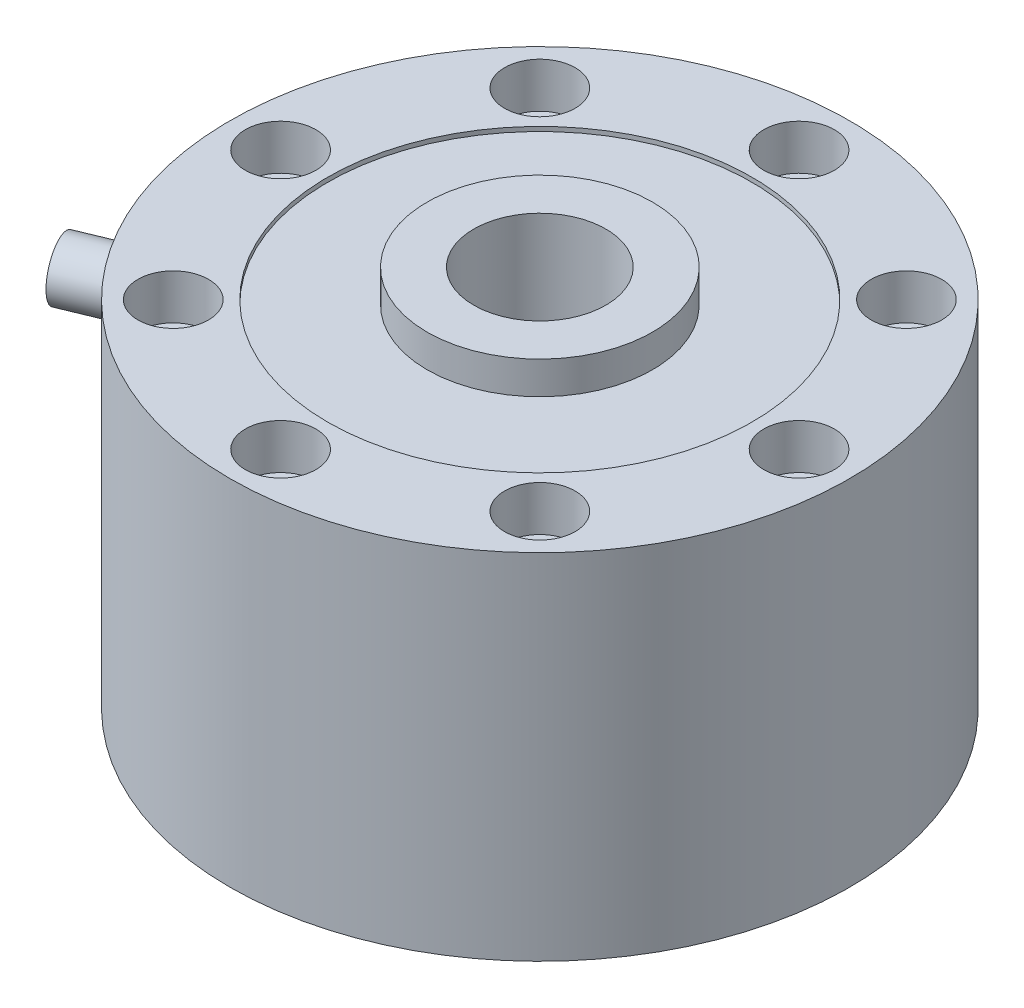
from build123d import *

# Parameters (mm, degrees)
SKETCH1_R                     = 69.85
BOSS_EXTRUDE1_DEPTH           = 79.756
SKETCH2_R                     = 25.4
BOSS_EXTRUDE2_DEPTH           = 6.35
BOSS_EXTRUDE3_START           = 1.27
SKETCH3_R                     = 25.4
BOSS_EXTRUDE3_DEPTH           = 1.27
F_1_1_4_12_TAPPED_HOLE1_D     = 29.76626
F_1_1_4_12_TAPPED_HOLE1_DEPTH = 38.1
F_1_1_4_12_TAPPED_HOLE1_TIP   = 8.942686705
F_1_1_4_12_TAPPED_HOLE4_D     = 29.76626
F_1_1_4_12_TAPPED_HOLE4_DEPTH = 30.48
F_1_1_4_12_TAPPED_HOLE4_TIP   = 8.942686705
SKETCH18_R                    = 5.1562
CUT_EXTRUDE2_DEPTH            = 128.762504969
SKETCH19_R                    = 7.9502
CUT_EXTRUDE3_DEPTH            = 10.16
CIRPATTERN1_COUNT             = 8
CUT_EXTRUDE4_START            = -1
SKETCH20_R                    = 47.818709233
SKETCH20_R_2                  = 25.4
CUT_EXTRUDE4_DEPTH            = 1
BOSS_EXTRUDE4_DEPTH           = 12.7
BOSS_EXTRUDE4_DEPTH_BACK      = 12.7
SKETCH22_R                    = 6.35


with BuildPart() as part:
    # Sketch1 → Boss-Extrude1 (new body)
    with BuildSketch(Plane(origin=(0, 0, 0), x_dir=(1, 0, 0), z_dir=(0, 1, 0))):
        with Locations(Location((0, 0, 0), (0, 0, 270))):
            Circle(SKETCH1_R)
    extrude(amount=BOSS_EXTRUDE1_DEPTH)

    # Sketch2 → Boss-Extrude2 (add)
    with BuildSketch(Plane(origin=(0, 79.756, 0), x_dir=(1, 0, 0), z_dir=(0, 1, 0))):
        with Locations(Location((0, 0, 0), (0, 0, 270))):
            Circle(SKETCH2_R)
    extrude(amount=BOSS_EXTRUDE2_DEPTH)

    # Sketch3 → Boss-Extrude3 (add)
    with BuildSketch(Plane.XZ.offset(BOSS_EXTRUDE3_START)):
        with Locations(Location((0, 0, 0), (0, 0, 90))):
            Circle(SKETCH3_R)
    extrude(amount=-BOSS_EXTRUDE3_DEPTH)

    # 1-1_4-12 Tapped Hole1
    with Locations(Plane(origin=(0, 86.106, 0), x_dir=(1, 0, 0), z_dir=(0, 1, 0))):
        with Locations((0, 0)):
            Hole(F_1_1_4_12_TAPPED_HOLE1_D / 2, depth=F_1_1_4_12_TAPPED_HOLE1_DEPTH)
            with Locations((0, 0, -(F_1_1_4_12_TAPPED_HOLE1_DEPTH + F_1_1_4_12_TAPPED_HOLE1_TIP / 2))):  # 118° drill point
                Cone(0, F_1_1_4_12_TAPPED_HOLE1_D / 2, F_1_1_4_12_TAPPED_HOLE1_TIP, mode=Mode.SUBTRACT)

    # 1-1_4-12 Tapped Hole4
    with Locations(Plane(origin=(0, -1.27, 0), x_dir=(-1, 0, 0), z_dir=(0, -1, 0))):
        with Locations((0, 0)):
            Hole(F_1_1_4_12_TAPPED_HOLE4_D / 2, depth=F_1_1_4_12_TAPPED_HOLE4_DEPTH)
            with Locations((0, 0, -(F_1_1_4_12_TAPPED_HOLE4_DEPTH + F_1_1_4_12_TAPPED_HOLE4_TIP / 2))):  # 118° drill point
                Cone(0, F_1_1_4_12_TAPPED_HOLE4_D / 2, F_1_1_4_12_TAPPED_HOLE4_TIP, mode=Mode.SUBTRACT)

    # Sketch18 → Cut-Extrude2 (cut, through all)
    with BuildSketch(Plane(origin=(0, 79.756, 0), x_dir=(1, 0, 0), z_dir=(0, 1, 0))):
        with Locations(Location((0, 58.42, 0), (0, 0, 270))):
            Circle(SKETCH18_R)
    cut_extrude2 = extrude(amount=-CUT_EXTRUDE2_DEPTH, mode=Mode.SUBTRACT)

    # Sketch19 → Cut-Extrude3 (cut)
    with BuildSketch(Plane(origin=(0, 79.756, 0), x_dir=(1, 0, 0), z_dir=(0, 1, 0))):
        with Locations(Location((0, 58.42, 0), (0, 0, 270))):
            Circle(SKETCH19_R)
    cut_extrude3 = extrude(amount=-CUT_EXTRUDE3_DEPTH, mode=Mode.SUBTRACT)

    # CirPattern1: Cut-Extrude2, Cut-Extrude3 ×8 about axis
    cirpattern1_axis = Axis((0, 0, 0), (0, 1, 0))
    add([cut_extrude2.rotate(cirpattern1_axis, i * 360 / CIRPATTERN1_COUNT) for i in range(1, CIRPATTERN1_COUNT)], mode=Mode.SUBTRACT)
    add([cut_extrude3.rotate(cirpattern1_axis, i * 360 / CIRPATTERN1_COUNT) for i in range(1, CIRPATTERN1_COUNT)], mode=Mode.SUBTRACT)

    # Sketch20 → Cut-Extrude4 (cut)
    with BuildSketch(Plane(origin=(0, 79.756, 0), x_dir=(1, 0, 0), z_dir=(0, 1, 0)).offset(CUT_EXTRUDE4_START)):
        with Locations(Location((0, 0, 0), (0, 0, 270))):
            Circle(SKETCH20_R)
        with Locations(Location((0, 0, 0), (0, 0, 270))):
            Circle(SKETCH20_R_2, mode=Mode.SUBTRACT)
    extrude(amount=CUT_EXTRUDE4_DEPTH, mode=Mode.SUBTRACT)

    # Sketch22 → Boss-Extrude4 (add, two sides: drawn at the far end of the back side and taken through both)
    with BuildSketch(Plane(origin=(-64.532985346, 0, 26.730437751), x_dir=(0.38268343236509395, 0, 0.9238795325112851), z_dir=(-0.9238795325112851, 0, 0.38268343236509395)).offset(-BOSS_EXTRUDE4_DEPTH_BACK)):
        with Locations(Location((0, 63.55109193, 0), (0, 0, 180))):
            Circle(SKETCH22_R)
    extrude(amount=BOSS_EXTRUDE4_DEPTH + BOSS_EXTRUDE4_DEPTH_BACK)


solid = part.part
